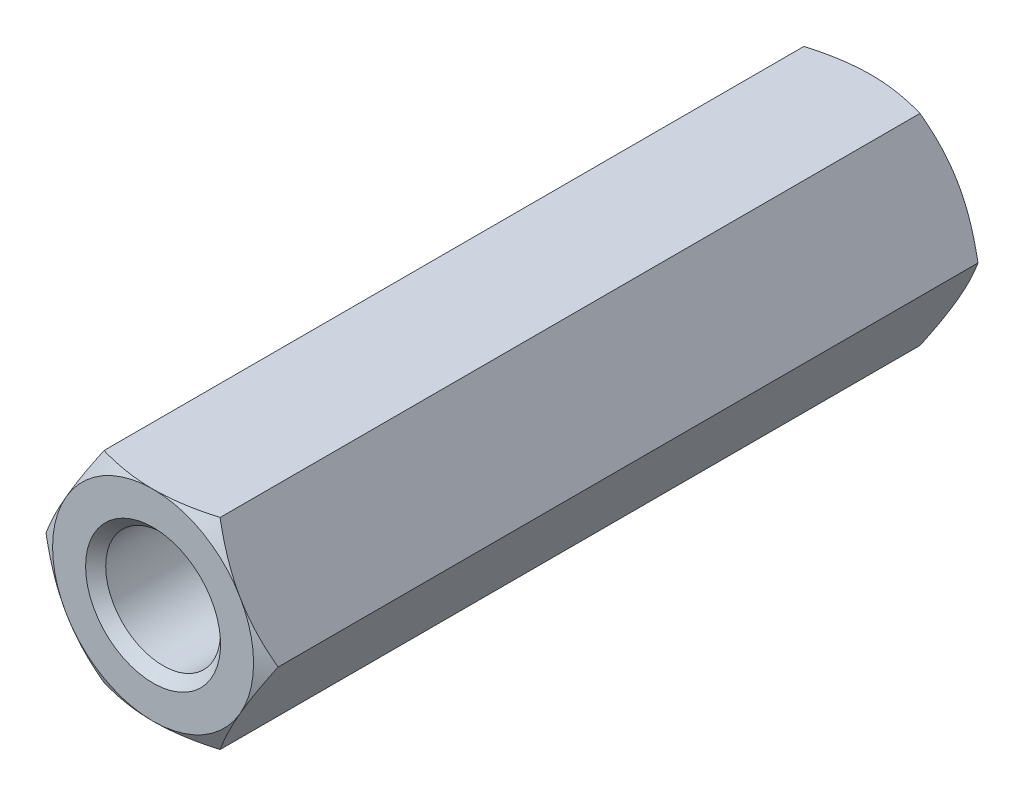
from build123d import *

# Parameters (mm, degrees)
BOSS_EXTRUDE1_DEPTH      = 12.5
SKETCH2_OUTSIDE_W        = 63.932
SKETCH2_OUTSIDE_H        = 62.85
SKETCH2_OUTSIDE_R        = 3.5
CUT_EXTRUDE1_DEPTH       = 14.59534234
CUT_EXTRUDE1_DRAFT       = -60
SKETCH3_R                = 2
SKETCH3_R_2              = 1.65
CUT_EXTRUDE2_DEPTH       = 10
SKETCH3_2_R              = 1.65
CUT_EXTRUDE3_DEPTH       = 11.05
CHAMFER1_SIZE            = 0.35
MIRROR1_COPY_1_SKETCH_W  = 63.932
MIRROR1_COPY_1_SKETCH_H  = 62.85
MIRROR1_COPY_1_SKETCH_R  = 3.5
MIRROR1_COPY_1_DEPTH     = 14.59534234
MIRROR1_COPY_1_DRAFT     = -60
CHAMFER1_OF_MIRROR1_SIZE = 0.35


with BuildPart() as part:
    # Sketch1 → Boss-Extrude1 (new body)
    with BuildSketch(Plane.XY):
        Polygon((2.020725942, 3.5), (-2.020725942, 3.5), (-4.041451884, 0), (-2.020725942, -3.5), (2.020725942, -3.5), (4.041451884, 0), align=None)
    boss_extrude1 = extrude(amount=-BOSS_EXTRUDE1_DEPTH)


with BuildPart() as cut_extrude1_tool:
    # Sketch2 outside → Cut-Extrude1 (with draft: the straight prism first)
    with BuildSketch(Plane(origin=(0, 0, -12.5), x_dir=(-1, 0, 0), z_dir=(0, 0, -1))):
        Rectangle(SKETCH2_OUTSIDE_W, SKETCH2_OUTSIDE_H)
        Circle(SKETCH2_OUTSIDE_R, mode=Mode.SUBTRACT)
    extrude(amount=-CUT_EXTRUDE1_DEPTH)
    # Cut-Extrude1: the draft: its side faces are tilted about the plane it starts from
    cut_extrude1_sides = [cut_extrude1_tool.faces().sort_by_distance(p)[0] for p in [
        (0, -31.425, -5.20232883),
        (-31.966, 0, -5.20232883),
        (0, 31.425, -5.20232883),
        (31.966, 0, -5.20232883),
        (3.5, 0, -5.20232883),
    ]]
    draft(cut_extrude1_sides, Plane(origin=(0, 0, -12.5), x_dir=(-1, 0, 0), z_dir=(0, 0, -1)), CUT_EXTRUDE1_DRAFT)


with BuildPart() as part_1:
    add(part.part)

    # Cut-Extrude1: cut by cut_extrude1_tool
    add(cut_extrude1_tool.part, mode=Mode.SUBTRACT)

    # Sketch3 → Cut-Extrude2 (cut)
    with BuildSketch(Plane(origin=(0, 0, -12.5), x_dir=(-1, 0, 0), z_dir=(0, 0, -1))):
        Circle(SKETCH3_R)
        Circle(SKETCH3_R_2, mode=Mode.SUBTRACT)
    cut_extrude2 = extrude(amount=-CUT_EXTRUDE2_DEPTH, mode=Mode.SUBTRACT)

    # Sketch3_2 → Cut-Extrude3 (cut)
    with BuildSketch(Plane(origin=(0, 0, -12.5), x_dir=(-1, 0, 0), z_dir=(0, 0, -1))):
        Circle(SKETCH3_2_R)
    cut_extrude3 = extrude(amount=-CUT_EXTRUDE3_DEPTH, mode=Mode.SUBTRACT)

    # Cut-Extrude4 cone 1 section (on through the dimple's axis) → Cut-Extrude4 (revolve, cut)
    with BuildSketch(Plane(origin=(0, 0, -1.45), x_dir=(0, 1, 0), z_dir=(1, 0, 0))):
        Polygon((0, 0), (1.65, 0), (0, 0.952627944), align=None)
    revolve(axis=Axis((0, 0, -1.45), (0, 0, 1)), mode=Mode.SUBTRACT)

    # Chamfer1
    chamfer1_edges = [part_1.edges().sort_by_distance(p)[0] for p in [
        (2, 0, -12.5),
    ]]
    chamfer(chamfer1_edges, length=CHAMFER1_SIZE)

    # Mirror1: Boss-Extrude1, Cut-Extrude2, Cut-Extrude3 across plane
    add(boss_extrude1.mirror(Plane.XY))
    add(cut_extrude2.mirror(Plane.XY), mode=Mode.SUBTRACT)
    add(cut_extrude3.mirror(Plane.XY), mode=Mode.SUBTRACT)


with BuildPart() as mirror1_copy_1_tool:
    # Mirror1 copy 1 sketch → Mirror1 copy 1 (with draft: the straight prism first)
    with BuildSketch(Plane(origin=(0, 0, 12.5), x_dir=(-1, 0, 0), z_dir=(0, 0, 1))):
        Rectangle(MIRROR1_COPY_1_SKETCH_W, MIRROR1_COPY_1_SKETCH_H)
        Circle(MIRROR1_COPY_1_SKETCH_R, mode=Mode.SUBTRACT)
    extrude(amount=-MIRROR1_COPY_1_DEPTH)
    # Mirror1 copy 1: the draft: its side faces are tilted about the plane it starts from
    mirror1_copy_1_sides = [mirror1_copy_1_tool.faces().sort_by_distance(p)[0] for p in [
        (0, -31.425, 5.20232883),
        (-31.966, 0, 5.20232883),
        (0, 31.425, 5.20232883),
        (31.966, 0, 5.20232883),
        (3.5, 0, 5.20232883),
    ]]
    draft(mirror1_copy_1_sides, Plane(origin=(0, 0, 12.5), x_dir=(-1, 0, 0), z_dir=(0, 0, 1)), MIRROR1_COPY_1_DRAFT)


with BuildPart() as part_2:
    add(part_1.part)

    # Mirror1 copy 1: cut by mirror1_copy_1_tool
    add(mirror1_copy_1_tool.part, mode=Mode.SUBTRACT)

    # Chamfer1 of Mirror1
    chamfer1_of_mirror1_edges = [part_2.edges().sort_by_distance(p)[0] for p in [
        (2, 0, 12.5),
    ]]
    chamfer(chamfer1_of_mirror1_edges, length=CHAMFER1_OF_MIRROR1_SIZE)


solid = part_2.part
